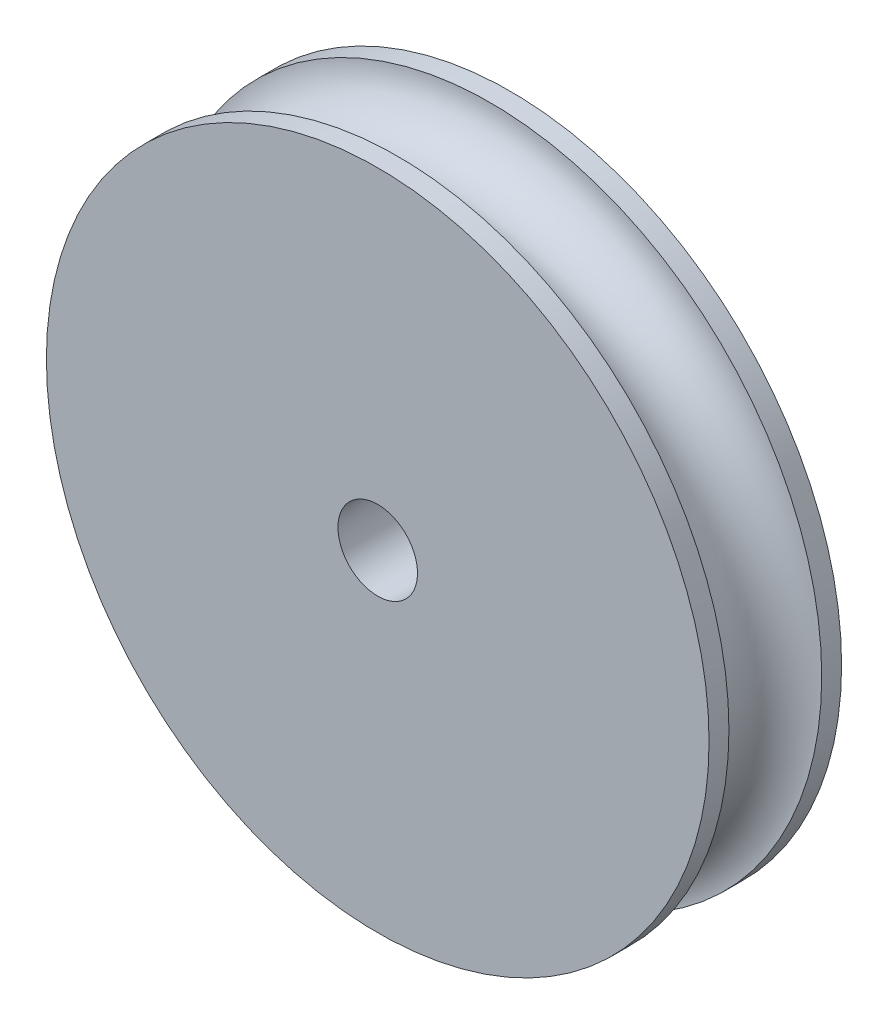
ISO-10303-21;
HEADER;
FILE_DESCRIPTION(('STEP AP214'),'2;1');
FILE_NAME('part.step','',(''),(''),'','','');
FILE_SCHEMA(('AUTOMOTIVE_DESIGN { 1 0 10303 214 1 1 1 1 }'));
ENDSEC;
DATA;
#1=APPLICATION_CONTEXT('core data for automotive mechanical design processes');
#2=APPLICATION_PROTOCOL_DEFINITION('international standard','automotive_design',2000,#1);
#3=PRODUCT_CONTEXT('',#1,'mechanical');
#4=PRODUCT('Part','Part','',(#3));
#5=PRODUCT_RELATED_PRODUCT_CATEGORY('part','',(#4));
#6=PRODUCT_DEFINITION_FORMATION('','',#4);
#7=PRODUCT_DEFINITION_CONTEXT('part definition',#1,'design');
#8=PRODUCT_DEFINITION('design','',#6,#7);
#9=PRODUCT_DEFINITION_SHAPE('','',#8);
#10=(LENGTH_UNIT() NAMED_UNIT(*) SI_UNIT(.MILLI.,.METRE.));
#11=(NAMED_UNIT(*) PLANE_ANGLE_UNIT() SI_UNIT($,.RADIAN.));
#12=(NAMED_UNIT(*) SI_UNIT($,.STERADIAN.) SOLID_ANGLE_UNIT());
#13=UNCERTAINTY_MEASURE_WITH_UNIT(LENGTH_MEASURE(1.E-05),#10,'distance_accuracy_value','');
#14=(GEOMETRIC_REPRESENTATION_CONTEXT(3) GLOBAL_UNCERTAINTY_ASSIGNED_CONTEXT((#13)) GLOBAL_UNIT_ASSIGNED_CONTEXT((#10,
#11,#12)) REPRESENTATION_CONTEXT('',''));
#15=CARTESIAN_POINT('',(0.,0.,0.));
#16=DIRECTION('',(0.,0.,1.));
#17=DIRECTION('',(1.,0.,0.));
#18=AXIS2_PLACEMENT_3D('',#15,#16,#17);
#19=CARTESIAN_POINT('',(0.,0.,2.5));
#20=DIRECTION('',(0.,0.,-1.));
#21=DIRECTION('',(-1.,0.,0.));
#22=AXIS2_PLACEMENT_3D('',#19,#20,#21);
#23=CYLINDRICAL_SURFACE('',#22,12.5);
#24=CARTESIAN_POINT('',(0.,0.,-2.5));
#25=DIRECTION('',(0.,0.,1.));
#26=DIRECTION('',(1.,0.,0.));
#27=AXIS2_PLACEMENT_3D('',#24,#25,#26);
#28=CIRCLE('',#27,12.5);
#29=CARTESIAN_POINT('',(12.5,0.,-2.5));
#30=VERTEX_POINT('',#29);
#31=EDGE_CURVE('E33',#30,#30,#28,.T.);
#32=ORIENTED_EDGE('',*,*,#31,.T.);
#33=EDGE_LOOP('',(#32));
#34=FACE_BOUND('',#33,.T.);
#35=CARTESIAN_POINT('',(0.,0.,-1.75));
#36=DIRECTION('',(0.,0.,-1.));
#37=DIRECTION('',(-1.,0.,0.));
#38=AXIS2_PLACEMENT_3D('',#35,#36,#37);
#39=CIRCLE('',#38,12.5);
#40=CARTESIAN_POINT('',(-12.5,0.,-1.75));
#41=VERTEX_POINT('',#40);
#42=EDGE_CURVE('E44',#41,#41,#39,.T.);
#43=ORIENTED_EDGE('',*,*,#42,.T.);
#44=EDGE_LOOP('',(#43));
#45=FACE_BOUND('',#44,.T.);
#46=ADVANCED_FACE('F30',(#34,#45),#23,.T.);
#47=CARTESIAN_POINT('',(0.,0.,-2.5));
#48=DIRECTION('',(0.,0.,1.));
#49=DIRECTION('',(1.,0.,0.));
#50=AXIS2_PLACEMENT_3D('',#47,#48,#49);
#51=PLANE('',#50);
#52=CARTESIAN_POINT('',(0.,0.,-2.5));
#53=DIRECTION('',(0.,0.,-1.));
#54=DIRECTION('',(-1.,0.,0.));
#55=AXIS2_PLACEMENT_3D('',#52,#53,#54);
#56=CIRCLE('',#55,1.5);
#57=CARTESIAN_POINT('',(-1.5,0.,-2.5));
#58=VERTEX_POINT('',#57);
#59=EDGE_CURVE('E48',#58,#58,#56,.T.);
#60=ORIENTED_EDGE('',*,*,#59,.F.);
#61=EDGE_LOOP('',(#60));
#62=FACE_BOUND('',#61,.T.);
#63=ORIENTED_EDGE('',*,*,#31,.F.);
#64=EDGE_LOOP('',(#63));
#65=FACE_BOUND('',#64,.T.);
#66=ADVANCED_FACE('F63',(#62,#65),#51,.F.);
#67=CARTESIAN_POINT('',(0.,0.,0.));
#68=DIRECTION('',(0.,0.,-1.));
#69=DIRECTION('',(-1.,0.,0.));
#70=AXIS2_PLACEMENT_3D('',#67,#68,#69);
#71=TOROIDAL_SURFACE('',#70,12.5,1.75);
#72=CARTESIAN_POINT('',(0.,0.,1.75));
#73=DIRECTION('',(0.,0.,-1.));
#74=DIRECTION('',(-1.,0.,0.));
#75=AXIS2_PLACEMENT_3D('',#72,#73,#74);
#76=CIRCLE('',#75,12.5);
#77=CARTESIAN_POINT('',(-12.5,0.,1.75));
#78=VERTEX_POINT('',#77);
#79=EDGE_CURVE('E40',#78,#78,#76,.T.);
#80=ORIENTED_EDGE('',*,*,#79,.T.);
#81=EDGE_LOOP('',(#80));
#82=FACE_BOUND('',#81,.T.);
#83=ORIENTED_EDGE('',*,*,#42,.F.);
#84=EDGE_LOOP('',(#83));
#85=FACE_BOUND('',#84,.T.);
#86=ADVANCED_FACE('F66',(#82,#85),#71,.F.);
#87=CARTESIAN_POINT('',(0.,0.,2.5));
#88=DIRECTION('',(0.,0.,1.));
#89=DIRECTION('',(1.,0.,0.));
#90=AXIS2_PLACEMENT_3D('',#87,#88,#89);
#91=PLANE('',#90);
#92=CARTESIAN_POINT('',(0.,0.,2.5));
#93=DIRECTION('',(0.,0.,-1.));
#94=DIRECTION('',(-1.,0.,0.));
#95=AXIS2_PLACEMENT_3D('',#92,#93,#94);
#96=CIRCLE('',#95,1.5);
#97=CARTESIAN_POINT('',(-1.5,0.,2.5));
#98=VERTEX_POINT('',#97);
#99=EDGE_CURVE('E47',#98,#98,#96,.T.);
#100=ORIENTED_EDGE('',*,*,#99,.T.);
#101=EDGE_LOOP('',(#100));
#102=FACE_BOUND('',#101,.T.);
#103=CARTESIAN_POINT('',(0.,0.,2.5));
#104=DIRECTION('',(0.,0.,1.));
#105=DIRECTION('',(1.,0.,0.));
#106=AXIS2_PLACEMENT_3D('',#103,#104,#105);
#107=CIRCLE('',#106,12.5);
#108=CARTESIAN_POINT('',(12.5,0.,2.5));
#109=VERTEX_POINT('',#108);
#110=EDGE_CURVE('E10',#109,#109,#107,.T.);
#111=ORIENTED_EDGE('',*,*,#110,.T.);
#112=EDGE_LOOP('',(#111));
#113=FACE_BOUND('',#112,.T.);
#114=ADVANCED_FACE('F54',(#102,#113),#91,.T.);
#115=ORIENTED_EDGE('',*,*,#110,.F.);
#116=EDGE_LOOP('',(#115));
#117=FACE_BOUND('',#116,.T.);
#118=ORIENTED_EDGE('',*,*,#79,.F.);
#119=EDGE_LOOP('',(#118));
#120=FACE_BOUND('',#119,.T.);
#121=ADVANCED_FACE('F59',(#117,#120),#23,.T.);
#122=CARTESIAN_POINT('',(0.,0.,2.5));
#123=DIRECTION('',(0.,0.,-1.));
#124=DIRECTION('',(-1.,0.,0.));
#125=AXIS2_PLACEMENT_3D('',#122,#123,#124);
#126=CYLINDRICAL_SURFACE('',#125,1.5);
#127=ORIENTED_EDGE('',*,*,#99,.F.);
#128=EDGE_LOOP('',(#127));
#129=FACE_BOUND('',#128,.T.);
#130=ORIENTED_EDGE('',*,*,#59,.T.);
#131=EDGE_LOOP('',(#130));
#132=FACE_BOUND('',#131,.T.);
#133=ADVANCED_FACE('F56',(#129,#132),#126,.F.);
#134=CLOSED_SHELL('',(#46,#66,#86,#114,#121,#133));
#135=MANIFOLD_SOLID_BREP('B2',#134);
#136=ADVANCED_BREP_SHAPE_REPRESENTATION('',(#18,#135),#14);
#137=SHAPE_DEFINITION_REPRESENTATION(#9,#136);
ENDSEC;
END-ISO-10303-21;
